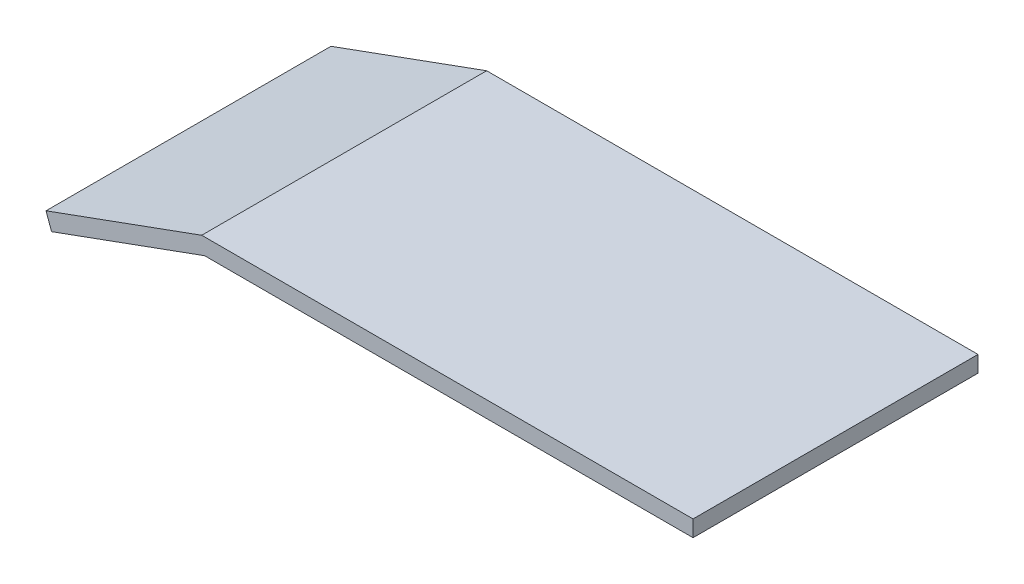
ISO-10303-21;
HEADER;
FILE_DESCRIPTION(('STEP AP214'),'2;1');
FILE_NAME('part.step','',(''),(''),'','','');
FILE_SCHEMA(('AUTOMOTIVE_DESIGN { 1 0 10303 214 1 1 1 1 }'));
ENDSEC;
DATA;
#1=APPLICATION_CONTEXT('core data for automotive mechanical design processes');
#2=APPLICATION_PROTOCOL_DEFINITION('international standard','automotive_design',2000,#1);
#3=PRODUCT_CONTEXT('',#1,'mechanical');
#4=PRODUCT('Part','Part','',(#3));
#5=PRODUCT_RELATED_PRODUCT_CATEGORY('part','',(#4));
#6=PRODUCT_DEFINITION_FORMATION('','',#4);
#7=PRODUCT_DEFINITION_CONTEXT('part definition',#1,'design');
#8=PRODUCT_DEFINITION('design','',#6,#7);
#9=PRODUCT_DEFINITION_SHAPE('','',#8);
#10=(LENGTH_UNIT() NAMED_UNIT(*) SI_UNIT(.MILLI.,.METRE.));
#11=(NAMED_UNIT(*) PLANE_ANGLE_UNIT() SI_UNIT($,.RADIAN.));
#12=(NAMED_UNIT(*) SI_UNIT($,.STERADIAN.) SOLID_ANGLE_UNIT());
#13=UNCERTAINTY_MEASURE_WITH_UNIT(LENGTH_MEASURE(1.E-05),#10,'distance_accuracy_value','');
#14=(GEOMETRIC_REPRESENTATION_CONTEXT(3) GLOBAL_UNCERTAINTY_ASSIGNED_CONTEXT((#13)) GLOBAL_UNIT_ASSIGNED_CONTEXT((#10,
#11,#12)) REPRESENTATION_CONTEXT('',''));
#15=CARTESIAN_POINT('',(0.,0.,0.));
#16=DIRECTION('',(0.,0.,1.));
#17=DIRECTION('',(1.,0.,0.));
#18=AXIS2_PLACEMENT_3D('',#15,#16,#17);
#19=CARTESIAN_POINT('',(-19.6879240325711,21.9525035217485,-35.));
#20=DIRECTION('',(-0.34202014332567,0.939692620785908,0.));
#21=DIRECTION('',(-0.939692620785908,-0.34202014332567,0.));
#22=AXIS2_PLACEMENT_3D('',#19,#20,#21);
#23=PLANE('',#22);
#24=DIRECTION('',(-0.939692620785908,-0.34202014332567,0.));
#25=VECTOR('',#24,1.);
#26=CARTESIAN_POINT('',(-19.6879240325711,21.9525035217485,0.));
#27=LINE('',#26,#25);
#28=CARTESIAN_POINT('',(-19.3565377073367,22.0731182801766,0.));
#29=VERTEX_POINT('',#28);
#30=CARTESIAN_POINT('',(-38.4817764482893,15.1121006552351,0.));
#31=VERTEX_POINT('',#30);
#32=EDGE_CURVE('E84',#29,#31,#27,.T.);
#33=ORIENTED_EDGE('',*,*,#32,.F.);
#34=DIRECTION('',(0.,0.,1.));
#35=VECTOR('',#34,1.);
#36=CARTESIAN_POINT('',(-19.3565377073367,22.0731182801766,-35.));
#37=LINE('',#36,#35);
#38=CARTESIAN_POINT('',(-19.3565377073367,22.0731182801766,-35.));
#39=VERTEX_POINT('',#38);
#40=EDGE_CURVE('E11',#39,#29,#37,.T.);
#41=ORIENTED_EDGE('',*,*,#40,.F.);
#42=DIRECTION('',(-0.939692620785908,-0.34202014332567,0.));
#43=VECTOR('',#42,1.);
#44=CARTESIAN_POINT('',(-19.6879240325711,21.9525035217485,-35.));
#45=LINE('',#44,#43);
#46=CARTESIAN_POINT('',(-38.4817764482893,15.1121006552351,-35.));
#47=VERTEX_POINT('',#46);
#48=EDGE_CURVE('E86',#39,#47,#45,.T.);
#49=ORIENTED_EDGE('',*,*,#48,.T.);
#50=DIRECTION('',(0.,0.,1.));
#51=VECTOR('',#50,1.);
#52=CARTESIAN_POINT('',(-38.4817764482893,15.1121006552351,-35.));
#53=LINE('',#52,#51);
#54=EDGE_CURVE('E34',#47,#31,#53,.T.);
#55=ORIENTED_EDGE('',*,*,#54,.T.);
#56=EDGE_LOOP('',(#33,#41,#49,#55));
#57=FACE_BOUND('',#56,.T.);
#58=ADVANCED_FACE('F31',(#57),#23,.T.);
#59=CARTESIAN_POINT('',(40.9961162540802,22.0731182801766,-35.));
#60=DIRECTION('',(0.,1.,0.));
#61=DIRECTION('',(-1.,0.,0.));
#62=AXIS2_PLACEMENT_3D('',#59,#60,#61);
#63=PLANE('',#62);
#64=DIRECTION('',(-1.,0.,0.));
#65=VECTOR('',#64,1.);
#66=CARTESIAN_POINT('',(40.9961162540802,22.0731182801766,0.));
#67=LINE('',#66,#65);
#68=CARTESIAN_POINT('',(40.9961162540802,22.0731182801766,0.));
#69=VERTEX_POINT('',#68);
#70=EDGE_CURVE('E102',#69,#29,#67,.T.);
#71=ORIENTED_EDGE('',*,*,#70,.F.);
#72=DIRECTION('',(0.,0.,1.));
#73=VECTOR('',#72,1.);
#74=CARTESIAN_POINT('',(40.9961162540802,22.0731182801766,-35.));
#75=LINE('',#74,#73);
#76=CARTESIAN_POINT('',(40.9961162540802,22.0731182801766,-35.));
#77=VERTEX_POINT('',#76);
#78=EDGE_CURVE('E39',#77,#69,#75,.T.);
#79=ORIENTED_EDGE('',*,*,#78,.F.);
#80=DIRECTION('',(-1.,0.,0.));
#81=VECTOR('',#80,1.);
#82=CARTESIAN_POINT('',(40.9961162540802,22.0731182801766,-35.));
#83=LINE('',#82,#81);
#84=EDGE_CURVE('E90',#77,#39,#83,.T.);
#85=ORIENTED_EDGE('',*,*,#84,.T.);
#86=ORIENTED_EDGE('',*,*,#40,.T.);
#87=EDGE_LOOP('',(#71,#79,#85,#86));
#88=FACE_BOUND('',#87,.T.);
#89=ADVANCED_FACE('F141',(#88),#63,.T.);
#90=CARTESIAN_POINT('',(40.9961162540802,22.0731182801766,-35.));
#91=DIRECTION('',(-1.,0.,0.));
#92=DIRECTION('',(0.,0.,1.));
#93=AXIS2_PLACEMENT_3D('',#90,#91,#92);
#94=PLANE('',#93);
#95=DIRECTION('',(0.,-1.,0.));
#96=VECTOR('',#95,1.);
#97=CARTESIAN_POINT('',(40.9961162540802,22.0731182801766,0.));
#98=LINE('',#97,#96);
#99=CARTESIAN_POINT('',(40.9961162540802,20.0731182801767,0.));
#100=VERTEX_POINT('',#99);
#101=EDGE_CURVE('E108',#69,#100,#98,.T.);
#102=ORIENTED_EDGE('',*,*,#101,.T.);
#103=DIRECTION('',(0.,0.,1.));
#104=VECTOR('',#103,1.);
#105=CARTESIAN_POINT('',(40.9961162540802,20.0731182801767,-35.));
#106=LINE('',#105,#104);
#107=CARTESIAN_POINT('',(40.9961162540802,20.0731182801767,-35.));
#108=VERTEX_POINT('',#107);
#109=EDGE_CURVE('E122',#108,#100,#106,.T.);
#110=ORIENTED_EDGE('',*,*,#109,.F.);
#111=DIRECTION('',(0.,-1.,0.));
#112=VECTOR('',#111,1.);
#113=CARTESIAN_POINT('',(40.9961162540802,22.0731182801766,-35.));
#114=LINE('',#113,#112);
#115=EDGE_CURVE('E118',#77,#108,#114,.T.);
#116=ORIENTED_EDGE('',*,*,#115,.F.);
#117=ORIENTED_EDGE('',*,*,#78,.T.);
#118=EDGE_LOOP('',(#102,#110,#116,#117));
#119=FACE_BOUND('',#118,.T.);
#120=ADVANCED_FACE('F137',(#119),#94,.F.);
#121=CARTESIAN_POINT('',(40.9961162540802,20.0731182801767,-35.));
#122=DIRECTION('',(0.,1.,0.));
#123=DIRECTION('',(-1.,0.,0.));
#124=AXIS2_PLACEMENT_3D('',#121,#122,#123);
#125=PLANE('',#124);
#126=DIRECTION('',(-1.,0.,0.));
#127=VECTOR('',#126,1.);
#128=CARTESIAN_POINT('',(40.9961162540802,20.0731182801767,0.));
#129=LINE('',#128,#127);
#130=CARTESIAN_POINT('',(-19.0038837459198,20.0731182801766,0.));
#131=VERTEX_POINT('',#130);
#132=EDGE_CURVE('E106',#100,#131,#129,.T.);
#133=ORIENTED_EDGE('',*,*,#132,.T.);
#134=DIRECTION('',(0.,0.,1.));
#135=VECTOR('',#134,1.);
#136=CARTESIAN_POINT('',(-19.0038837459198,20.0731182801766,-35.));
#137=LINE('',#136,#135);
#138=CARTESIAN_POINT('',(-19.0038837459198,20.0731182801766,-35.));
#139=VERTEX_POINT('',#138);
#140=EDGE_CURVE('E125',#139,#131,#137,.T.);
#141=ORIENTED_EDGE('',*,*,#140,.F.);
#142=DIRECTION('',(-1.,0.,0.));
#143=VECTOR('',#142,1.);
#144=CARTESIAN_POINT('',(40.9961162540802,20.0731182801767,-35.));
#145=LINE('',#144,#143);
#146=EDGE_CURVE('E116',#108,#139,#145,.T.);
#147=ORIENTED_EDGE('',*,*,#146,.F.);
#148=ORIENTED_EDGE('',*,*,#109,.T.);
#149=EDGE_LOOP('',(#133,#141,#147,#148));
#150=FACE_BOUND('',#149,.T.);
#151=ADVANCED_FACE('F134',(#150),#125,.F.);
#152=CARTESIAN_POINT('',(-19.0038837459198,20.0731182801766,-35.));
#153=DIRECTION('',(-0.34202014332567,0.939692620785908,0.));
#154=DIRECTION('',(-0.939692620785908,-0.34202014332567,0.));
#155=AXIS2_PLACEMENT_3D('',#152,#153,#154);
#156=PLANE('',#155);
#157=DIRECTION('',(-0.939692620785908,-0.34202014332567,0.));
#158=VECTOR('',#157,1.);
#159=CARTESIAN_POINT('',(-19.0038837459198,20.0731182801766,0.));
#160=LINE('',#159,#158);
#161=CARTESIAN_POINT('',(-37.7977361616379,13.2327154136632,0.));
#162=VERTEX_POINT('',#161);
#163=EDGE_CURVE('E98',#131,#162,#160,.T.);
#164=ORIENTED_EDGE('',*,*,#163,.T.);
#165=DIRECTION('',(0.,0.,1.));
#166=VECTOR('',#165,1.);
#167=CARTESIAN_POINT('',(-37.7977361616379,13.2327154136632,-35.));
#168=LINE('',#167,#166);
#169=CARTESIAN_POINT('',(-37.7977361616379,13.2327154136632,-35.));
#170=VERTEX_POINT('',#169);
#171=EDGE_CURVE('E89',#170,#162,#168,.T.);
#172=ORIENTED_EDGE('',*,*,#171,.F.);
#173=DIRECTION('',(-0.939692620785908,-0.34202014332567,0.));
#174=VECTOR('',#173,1.);
#175=CARTESIAN_POINT('',(-19.0038837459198,20.0731182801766,-35.));
#176=LINE('',#175,#174);
#177=EDGE_CURVE('E114',#139,#170,#176,.T.);
#178=ORIENTED_EDGE('',*,*,#177,.F.);
#179=ORIENTED_EDGE('',*,*,#140,.T.);
#180=EDGE_LOOP('',(#164,#172,#178,#179));
#181=FACE_BOUND('',#180,.T.);
#182=ADVANCED_FACE('F130',(#181),#156,.F.);
#183=CARTESIAN_POINT('',(-37.7977361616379,13.2327154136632,-35.));
#184=DIRECTION('',(0.939692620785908,0.342020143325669,0.));
#185=DIRECTION('',(-0.342020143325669,0.939692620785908,0.));
#186=AXIS2_PLACEMENT_3D('',#183,#184,#185);
#187=PLANE('',#186);
#188=DIRECTION('',(-0.342020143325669,0.939692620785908,0.));
#189=VECTOR('',#188,1.);
#190=CARTESIAN_POINT('',(-37.7977361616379,13.2327154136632,0.));
#191=LINE('',#190,#189);
#192=EDGE_CURVE('E93',#162,#31,#191,.T.);
#193=ORIENTED_EDGE('',*,*,#192,.T.);
#194=ORIENTED_EDGE('',*,*,#54,.F.);
#195=DIRECTION('',(-0.342020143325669,0.939692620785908,0.));
#196=VECTOR('',#195,1.);
#197=CARTESIAN_POINT('',(-37.7977361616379,13.2327154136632,-35.));
#198=LINE('',#197,#196);
#199=EDGE_CURVE('E112',#170,#47,#198,.T.);
#200=ORIENTED_EDGE('',*,*,#199,.F.);
#201=ORIENTED_EDGE('',*,*,#171,.T.);
#202=EDGE_LOOP('',(#193,#194,#200,#201));
#203=FACE_BOUND('',#202,.T.);
#204=ADVANCED_FACE('F94',(#203),#187,.F.);
#205=CARTESIAN_POINT('',(-38.4817764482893,15.1121006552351,-35.));
#206=DIRECTION('',(0.,0.,-1.));
#207=DIRECTION('',(-1.,0.,0.));
#208=AXIS2_PLACEMENT_3D('',#205,#206,#207);
#209=PLANE('',#208);
#210=ORIENTED_EDGE('',*,*,#48,.F.);
#211=ORIENTED_EDGE('',*,*,#84,.F.);
#212=ORIENTED_EDGE('',*,*,#115,.T.);
#213=ORIENTED_EDGE('',*,*,#146,.T.);
#214=ORIENTED_EDGE('',*,*,#177,.T.);
#215=ORIENTED_EDGE('',*,*,#199,.T.);
#216=EDGE_LOOP('',(#210,#211,#212,#213,#214,#215));
#217=FACE_BOUND('',#216,.T.);
#218=ADVANCED_FACE('F140',(#217),#209,.T.);
#219=CARTESIAN_POINT('',(-38.4817764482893,15.1121006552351,0.));
#220=DIRECTION('',(0.,0.,-1.));
#221=DIRECTION('',(-1.,0.,0.));
#222=AXIS2_PLACEMENT_3D('',#219,#220,#221);
#223=PLANE('',#222);
#224=ORIENTED_EDGE('',*,*,#32,.T.);
#225=ORIENTED_EDGE('',*,*,#192,.F.);
#226=ORIENTED_EDGE('',*,*,#163,.F.);
#227=ORIENTED_EDGE('',*,*,#132,.F.);
#228=ORIENTED_EDGE('',*,*,#101,.F.);
#229=ORIENTED_EDGE('',*,*,#70,.T.);
#230=EDGE_LOOP('',(#224,#225,#226,#227,#228,#229));
#231=FACE_BOUND('',#230,.T.);
#232=ADVANCED_FACE('F100',(#231),#223,.F.);
#233=CLOSED_SHELL('',(#58,#89,#120,#151,#182,#204,#218,#232));
#234=MANIFOLD_SOLID_BREP('B2',#233);
#235=ADVANCED_BREP_SHAPE_REPRESENTATION('',(#18,#234),#14);
#236=SHAPE_DEFINITION_REPRESENTATION(#9,#235);
ENDSEC;
END-ISO-10303-21;
